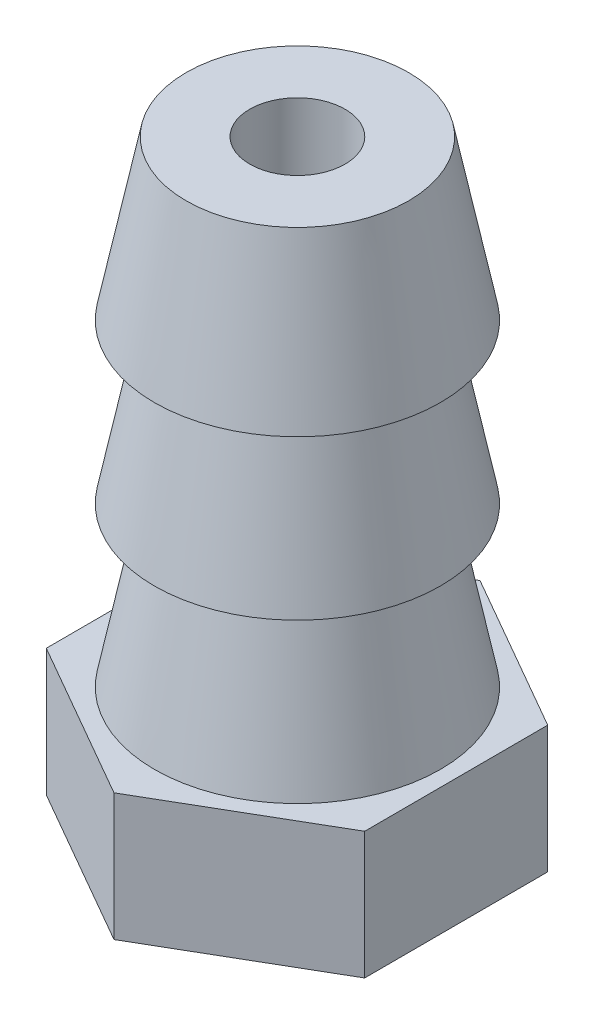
ISO-10303-21;
HEADER;
FILE_DESCRIPTION(('STEP AP214'),'2;1');
FILE_NAME('part.step','',(''),(''),'','','');
FILE_SCHEMA(('AUTOMOTIVE_DESIGN { 1 0 10303 214 1 1 1 1 }'));
ENDSEC;
DATA;
#1=APPLICATION_CONTEXT('core data for automotive mechanical design processes');
#2=APPLICATION_PROTOCOL_DEFINITION('international standard','automotive_design',2000,#1);
#3=PRODUCT_CONTEXT('',#1,'mechanical');
#4=PRODUCT('Part','Part','',(#3));
#5=PRODUCT_RELATED_PRODUCT_CATEGORY('part','',(#4));
#6=PRODUCT_DEFINITION_FORMATION('','',#4);
#7=PRODUCT_DEFINITION_CONTEXT('part definition',#1,'design');
#8=PRODUCT_DEFINITION('design','',#6,#7);
#9=PRODUCT_DEFINITION_SHAPE('','',#8);
#10=(LENGTH_UNIT() NAMED_UNIT(*) SI_UNIT(.MILLI.,.METRE.));
#11=(NAMED_UNIT(*) PLANE_ANGLE_UNIT() SI_UNIT($,.RADIAN.));
#12=(NAMED_UNIT(*) SI_UNIT($,.STERADIAN.) SOLID_ANGLE_UNIT());
#13=UNCERTAINTY_MEASURE_WITH_UNIT(LENGTH_MEASURE(1.E-05),#10,'distance_accuracy_value','');
#14=(GEOMETRIC_REPRESENTATION_CONTEXT(3) GLOBAL_UNCERTAINTY_ASSIGNED_CONTEXT((#13)) GLOBAL_UNIT_ASSIGNED_CONTEXT((#10,
#11,#12)) REPRESENTATION_CONTEXT('',''));
#15=CARTESIAN_POINT('',(0.,0.,0.));
#16=DIRECTION('',(0.,0.,1.));
#17=DIRECTION('',(1.,0.,0.));
#18=AXIS2_PLACEMENT_3D('',#15,#16,#17);
#19=CARTESIAN_POINT('',(-2.49679300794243,2.,1.44891614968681));
#20=DIRECTION('',(0.,1.,0.));
#21=DIRECTION('',(0.,0.,1.));
#22=AXIS2_PLACEMENT_3D('',#19,#20,#21);
#23=PLANE('',#22);
#24=DIRECTION('',(0.00221761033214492,0.,0.999997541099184));
#25=VECTOR('',#24,1.);
#26=CARTESIAN_POINT('',(-2.50319469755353,2.,-1.43782809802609));
#27=LINE('',#26,#25);
#28=CARTESIAN_POINT('',(-2.50319469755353,2.,-1.43782809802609));
#29=VERTEX_POINT('',#28);
#30=CARTESIAN_POINT('',(-2.49679300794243,2.,1.44891614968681));
#31=VERTEX_POINT('',#30);
#32=EDGE_CURVE('E130',#29,#31,#27,.T.);
#33=ORIENTED_EDGE('',*,*,#32,.T.);
#34=DIRECTION('',(0.867132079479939,0.,0.49807826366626));
#35=VECTOR('',#34,1.);
#36=CARTESIAN_POINT('',(-2.49679300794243,2.,1.44891614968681));
#37=LINE('',#36,#35);
#38=CARTESIAN_POINT('',(0.00640168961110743,2.,2.88674424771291));
#39=VERTEX_POINT('',#38);
#40=EDGE_CURVE('E88',#31,#39,#37,.T.);
#41=ORIENTED_EDGE('',*,*,#40,.T.);
#42=DIRECTION('',(0.864914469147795,0.,-0.501919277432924));
#43=VECTOR('',#42,1.);
#44=CARTESIAN_POINT('',(0.00640168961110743,2.,2.88674424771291));
#45=LINE('',#44,#43);
#46=CARTESIAN_POINT('',(2.50319469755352,2.,1.4378280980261));
#47=VERTEX_POINT('',#46);
#48=EDGE_CURVE('E101',#39,#47,#45,.T.);
#49=ORIENTED_EDGE('',*,*,#48,.T.);
#50=DIRECTION('',(-0.00221761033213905,0.,-0.999997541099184));
#51=VECTOR('',#50,1.);
#52=CARTESIAN_POINT('',(2.50319469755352,2.,1.4378280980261));
#53=LINE('',#52,#51);
#54=CARTESIAN_POINT('',(2.49679300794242,2.,-1.44891614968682));
#55=VERTEX_POINT('',#54);
#56=EDGE_CURVE('E95',#47,#55,#53,.T.);
#57=ORIENTED_EDGE('',*,*,#56,.T.);
#58=DIRECTION('',(-0.867132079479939,0.,-0.49807826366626));
#59=VECTOR('',#58,1.);
#60=CARTESIAN_POINT('',(2.49679300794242,2.,-1.44891614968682));
#61=LINE('',#60,#59);
#62=CARTESIAN_POINT('',(-0.0064016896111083,2.,-2.88674424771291));
#63=VERTEX_POINT('',#62);
#64=EDGE_CURVE('E99',#55,#63,#61,.T.);
#65=ORIENTED_EDGE('',*,*,#64,.T.);
#66=DIRECTION('',(-0.864914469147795,0.,0.501919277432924));
#67=VECTOR('',#66,1.);
#68=CARTESIAN_POINT('',(-0.0064016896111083,2.,-2.88674424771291));
#69=LINE('',#68,#67);
#70=EDGE_CURVE('E51',#63,#29,#69,.T.);
#71=ORIENTED_EDGE('',*,*,#70,.T.);
#72=EDGE_LOOP('',(#33,#41,#49,#57,#65,#71));
#73=FACE_BOUND('',#72,.T.);
#74=CARTESIAN_POINT('',(0.00640168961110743,2.,0.));
#75=DIRECTION('',(0.,-1.,0.));
#76=DIRECTION('',(0.,0.,-1.));
#77=AXIS2_PLACEMENT_3D('',#74,#75,#76);
#78=CIRCLE('',#77,2.25);
#79=CARTESIAN_POINT('',(0.00640168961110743,2.,-2.25));
#80=VERTEX_POINT('',#79);
#81=EDGE_CURVE('E123',#80,#80,#78,.T.);
#82=ORIENTED_EDGE('',*,*,#81,.T.);
#83=EDGE_LOOP('',(#82));
#84=FACE_BOUND('',#83,.T.);
#85=ADVANCED_FACE('F34',(#73,#84),#23,.T.);
#86=CARTESIAN_POINT('',(-2.50319469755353,2.,-1.43782809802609));
#87=DIRECTION('',(0.999997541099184,0.,-0.00221761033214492));
#88=DIRECTION('',(-0.00221761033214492,0.,-0.999997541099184));
#89=AXIS2_PLACEMENT_3D('',#86,#87,#88);
#90=PLANE('',#89);
#91=DIRECTION('',(0.00221761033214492,0.,0.999997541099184));
#92=VECTOR('',#91,1.);
#93=CARTESIAN_POINT('',(-2.50319469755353,0.,-1.43782809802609));
#94=LINE('',#93,#92);
#95=CARTESIAN_POINT('',(-2.50319469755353,0.,-1.43782809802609));
#96=VERTEX_POINT('',#95);
#97=CARTESIAN_POINT('',(-2.49679300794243,0.,1.44891614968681));
#98=VERTEX_POINT('',#97);
#99=EDGE_CURVE('E119',#96,#98,#94,.T.);
#100=ORIENTED_EDGE('',*,*,#99,.T.);
#101=DIRECTION('',(0.,-1.,0.));
#102=VECTOR('',#101,1.);
#103=CARTESIAN_POINT('',(-2.49679300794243,2.,1.44891614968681));
#104=LINE('',#103,#102);
#105=EDGE_CURVE('E11',#31,#98,#104,.T.);
#106=ORIENTED_EDGE('',*,*,#105,.F.);
#107=ORIENTED_EDGE('',*,*,#32,.F.);
#108=DIRECTION('',(0.,-1.,0.));
#109=VECTOR('',#108,1.);
#110=CARTESIAN_POINT('',(-2.50319469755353,2.,-1.43782809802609));
#111=LINE('',#110,#109);
#112=EDGE_CURVE('E115',#29,#96,#111,.T.);
#113=ORIENTED_EDGE('',*,*,#112,.T.);
#114=EDGE_LOOP('',(#100,#106,#107,#113));
#115=FACE_BOUND('',#114,.T.);
#116=ADVANCED_FACE('F36',(#115),#90,.F.);
#117=CARTESIAN_POINT('',(-2.49679300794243,2.,1.44891614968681));
#118=DIRECTION('',(0.49807826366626,0.,-0.867132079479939));
#119=DIRECTION('',(-0.867132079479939,0.,-0.49807826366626));
#120=AXIS2_PLACEMENT_3D('',#117,#118,#119);
#121=PLANE('',#120);
#122=DIRECTION('',(0.867132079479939,0.,0.49807826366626));
#123=VECTOR('',#122,1.);
#124=CARTESIAN_POINT('',(-2.49679300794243,0.,1.44891614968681));
#125=LINE('',#124,#123);
#126=CARTESIAN_POINT('',(0.00640168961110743,0.,2.88674424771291));
#127=VERTEX_POINT('',#126);
#128=EDGE_CURVE('E122',#98,#127,#125,.T.);
#129=ORIENTED_EDGE('',*,*,#128,.T.);
#130=DIRECTION('',(0.,-1.,0.));
#131=VECTOR('',#130,1.);
#132=CARTESIAN_POINT('',(0.00640168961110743,2.,2.88674424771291));
#133=LINE('',#132,#131);
#134=EDGE_CURVE('E43',#39,#127,#133,.T.);
#135=ORIENTED_EDGE('',*,*,#134,.F.);
#136=ORIENTED_EDGE('',*,*,#40,.F.);
#137=ORIENTED_EDGE('',*,*,#105,.T.);
#138=EDGE_LOOP('',(#129,#135,#136,#137));
#139=FACE_BOUND('',#138,.T.);
#140=ADVANCED_FACE('F159',(#139),#121,.F.);
#141=CARTESIAN_POINT('',(0.00640168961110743,2.,2.88674424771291));
#142=DIRECTION('',(-0.501919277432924,0.,-0.864914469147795));
#143=DIRECTION('',(-0.864914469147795,0.,0.501919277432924));
#144=AXIS2_PLACEMENT_3D('',#141,#142,#143);
#145=PLANE('',#144);
#146=DIRECTION('',(0.864914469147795,0.,-0.501919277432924));
#147=VECTOR('',#146,1.);
#148=CARTESIAN_POINT('',(0.00640168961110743,0.,2.88674424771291));
#149=LINE('',#148,#147);
#150=CARTESIAN_POINT('',(2.50319469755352,0.,1.4378280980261));
#151=VERTEX_POINT('',#150);
#152=EDGE_CURVE('E125',#127,#151,#149,.T.);
#153=ORIENTED_EDGE('',*,*,#152,.T.);
#154=DIRECTION('',(0.,-1.,0.));
#155=VECTOR('',#154,1.);
#156=CARTESIAN_POINT('',(2.50319469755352,2.,1.4378280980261));
#157=LINE('',#156,#155);
#158=EDGE_CURVE('E110',#47,#151,#157,.T.);
#159=ORIENTED_EDGE('',*,*,#158,.F.);
#160=ORIENTED_EDGE('',*,*,#48,.F.);
#161=ORIENTED_EDGE('',*,*,#134,.T.);
#162=EDGE_LOOP('',(#153,#159,#160,#161));
#163=FACE_BOUND('',#162,.T.);
#164=ADVANCED_FACE('F136',(#163),#145,.F.);
#165=CARTESIAN_POINT('',(2.50319469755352,2.,1.4378280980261));
#166=DIRECTION('',(-0.999997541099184,0.,0.00221761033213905));
#167=DIRECTION('',(0.00221761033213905,0.,0.999997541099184));
#168=AXIS2_PLACEMENT_3D('',#165,#166,#167);
#169=PLANE('',#168);
#170=DIRECTION('',(-0.00221761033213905,0.,-0.999997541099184));
#171=VECTOR('',#170,1.);
#172=CARTESIAN_POINT('',(2.50319469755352,0.,1.4378280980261));
#173=LINE('',#172,#171);
#174=CARTESIAN_POINT('',(2.49679300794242,0.,-1.44891614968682));
#175=VERTEX_POINT('',#174);
#176=EDGE_CURVE('E109',#151,#175,#173,.T.);
#177=ORIENTED_EDGE('',*,*,#176,.T.);
#178=DIRECTION('',(0.,-1.,0.));
#179=VECTOR('',#178,1.);
#180=CARTESIAN_POINT('',(2.49679300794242,2.,-1.44891614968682));
#181=LINE('',#180,#179);
#182=EDGE_CURVE('E106',#55,#175,#181,.T.);
#183=ORIENTED_EDGE('',*,*,#182,.F.);
#184=ORIENTED_EDGE('',*,*,#56,.F.);
#185=ORIENTED_EDGE('',*,*,#158,.T.);
#186=EDGE_LOOP('',(#177,#183,#184,#185));
#187=FACE_BOUND('',#186,.T.);
#188=ADVANCED_FACE('F107',(#187),#169,.F.);
#189=CARTESIAN_POINT('',(2.49679300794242,2.,-1.44891614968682));
#190=DIRECTION('',(-0.49807826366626,0.,0.867132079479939));
#191=DIRECTION('',(0.867132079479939,0.,0.49807826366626));
#192=AXIS2_PLACEMENT_3D('',#189,#190,#191);
#193=PLANE('',#192);
#194=DIRECTION('',(-0.867132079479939,0.,-0.49807826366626));
#195=VECTOR('',#194,1.);
#196=CARTESIAN_POINT('',(2.49679300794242,0.,-1.44891614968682));
#197=LINE('',#196,#195);
#198=CARTESIAN_POINT('',(-0.0064016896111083,0.,-2.88674424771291));
#199=VERTEX_POINT('',#198);
#200=EDGE_CURVE('E74',#175,#199,#197,.T.);
#201=ORIENTED_EDGE('',*,*,#200,.T.);
#202=DIRECTION('',(0.,-1.,0.));
#203=VECTOR('',#202,1.);
#204=CARTESIAN_POINT('',(-0.0064016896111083,2.,-2.88674424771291));
#205=LINE('',#204,#203);
#206=EDGE_CURVE('E111',#63,#199,#205,.T.);
#207=ORIENTED_EDGE('',*,*,#206,.F.);
#208=ORIENTED_EDGE('',*,*,#64,.F.);
#209=ORIENTED_EDGE('',*,*,#182,.T.);
#210=EDGE_LOOP('',(#201,#207,#208,#209));
#211=FACE_BOUND('',#210,.T.);
#212=ADVANCED_FACE('F113',(#211),#193,.F.);
#213=CARTESIAN_POINT('',(-0.0064016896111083,2.,-2.88674424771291));
#214=DIRECTION('',(0.501919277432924,0.,0.864914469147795));
#215=DIRECTION('',(0.864914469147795,0.,-0.501919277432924));
#216=AXIS2_PLACEMENT_3D('',#213,#214,#215);
#217=PLANE('',#216);
#218=DIRECTION('',(-0.864914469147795,0.,0.501919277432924));
#219=VECTOR('',#218,1.);
#220=CARTESIAN_POINT('',(-0.0064016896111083,0.,-2.88674424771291));
#221=LINE('',#220,#219);
#222=EDGE_CURVE('E80',#199,#96,#221,.T.);
#223=ORIENTED_EDGE('',*,*,#222,.T.);
#224=ORIENTED_EDGE('',*,*,#112,.F.);
#225=ORIENTED_EDGE('',*,*,#70,.F.);
#226=ORIENTED_EDGE('',*,*,#206,.T.);
#227=EDGE_LOOP('',(#223,#224,#225,#226));
#228=FACE_BOUND('',#227,.T.);
#229=ADVANCED_FACE('F143',(#228),#217,.F.);
#230=CARTESIAN_POINT('',(-2.49679300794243,0.,1.44891614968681));
#231=DIRECTION('',(0.,1.,0.));
#232=DIRECTION('',(0.,0.,1.));
#233=AXIS2_PLACEMENT_3D('',#230,#231,#232);
#234=PLANE('',#233);
#235=CARTESIAN_POINT('',(0.00640168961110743,0.,0.));
#236=DIRECTION('',(0.,1.,0.));
#237=DIRECTION('',(0.,0.,1.));
#238=AXIS2_PLACEMENT_3D('',#235,#236,#237);
#239=CIRCLE('',#238,0.75);
#240=CARTESIAN_POINT('',(0.00640168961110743,0.,0.75));
#241=VERTEX_POINT('',#240);
#242=EDGE_CURVE('E192',#241,#241,#239,.T.);
#243=ORIENTED_EDGE('',*,*,#242,.T.);
#244=EDGE_LOOP('',(#243));
#245=FACE_BOUND('',#244,.T.);
#246=ORIENTED_EDGE('',*,*,#99,.F.);
#247=ORIENTED_EDGE('',*,*,#222,.F.);
#248=ORIENTED_EDGE('',*,*,#200,.F.);
#249=ORIENTED_EDGE('',*,*,#176,.F.);
#250=ORIENTED_EDGE('',*,*,#152,.F.);
#251=ORIENTED_EDGE('',*,*,#128,.F.);
#252=EDGE_LOOP('',(#246,#247,#248,#249,#250,#251));
#253=FACE_BOUND('',#252,.T.);
#254=ADVANCED_FACE('F139',(#245,#253),#234,.F.);
#255=CARTESIAN_POINT('',(0.00640168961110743,4.5,0.));
#256=DIRECTION('',(0.,-1.,0.));
#257=DIRECTION('',(0.,0.,-1.));
#258=AXIS2_PLACEMENT_3D('',#255,#256,#257);
#259=CONICAL_SURFACE('',#258,1.75,0.197395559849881);
#260=ORIENTED_EDGE('',*,*,#81,.F.);
#261=EDGE_LOOP('',(#260));
#262=FACE_BOUND('',#261,.T.);
#263=CARTESIAN_POINT('',(0.00640168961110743,4.5,0.));
#264=DIRECTION('',(0.,-1.,0.));
#265=DIRECTION('',(0.,0.,-1.));
#266=AXIS2_PLACEMENT_3D('',#263,#264,#265);
#267=CIRCLE('',#266,1.75);
#268=CARTESIAN_POINT('',(0.00640168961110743,4.5,-1.75));
#269=VERTEX_POINT('',#268);
#270=EDGE_CURVE('E211',#269,#269,#267,.T.);
#271=ORIENTED_EDGE('',*,*,#270,.T.);
#272=EDGE_LOOP('',(#271));
#273=FACE_BOUND('',#272,.T.);
#274=ADVANCED_FACE('F150',(#262,#273),#259,.T.);
#275=CARTESIAN_POINT('',(-1.74359831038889,4.5,0.));
#276=DIRECTION('',(0.,1.,0.));
#277=DIRECTION('',(0.,0.,1.));
#278=AXIS2_PLACEMENT_3D('',#275,#276,#277);
#279=PLANE('',#278);
#280=ORIENTED_EDGE('',*,*,#270,.F.);
#281=EDGE_LOOP('',(#280));
#282=FACE_BOUND('',#281,.T.);
#283=CARTESIAN_POINT('',(0.00640168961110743,4.5,0.));
#284=DIRECTION('',(0.,-1.,0.));
#285=DIRECTION('',(0.,0.,-1.));
#286=AXIS2_PLACEMENT_3D('',#283,#284,#285);
#287=CIRCLE('',#286,2.25);
#288=CARTESIAN_POINT('',(0.00640168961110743,4.5,-2.25));
#289=VERTEX_POINT('',#288);
#290=EDGE_CURVE('E208',#289,#289,#287,.T.);
#291=ORIENTED_EDGE('',*,*,#290,.T.);
#292=EDGE_LOOP('',(#291));
#293=FACE_BOUND('',#292,.T.);
#294=ADVANCED_FACE('F163',(#282,#293),#279,.F.);
#295=CARTESIAN_POINT('',(0.00640168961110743,7.,0.));
#296=DIRECTION('',(0.,-1.,0.));
#297=DIRECTION('',(0.,0.,-1.));
#298=AXIS2_PLACEMENT_3D('',#295,#296,#297);
#299=CONICAL_SURFACE('',#298,1.75,0.197395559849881);
#300=ORIENTED_EDGE('',*,*,#290,.F.);
#301=EDGE_LOOP('',(#300));
#302=FACE_BOUND('',#301,.T.);
#303=CARTESIAN_POINT('',(0.00640168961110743,7.,0.));
#304=DIRECTION('',(0.,-1.,0.));
#305=DIRECTION('',(0.,0.,-1.));
#306=AXIS2_PLACEMENT_3D('',#303,#304,#305);
#307=CIRCLE('',#306,1.75);
#308=CARTESIAN_POINT('',(0.00640168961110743,7.,-1.75));
#309=VERTEX_POINT('',#308);
#310=EDGE_CURVE('E205',#309,#309,#307,.T.);
#311=ORIENTED_EDGE('',*,*,#310,.T.);
#312=EDGE_LOOP('',(#311));
#313=FACE_BOUND('',#312,.T.);
#314=ADVANCED_FACE('F167',(#302,#313),#299,.T.);
#315=CARTESIAN_POINT('',(-1.74359831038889,7.,0.));
#316=DIRECTION('',(0.,1.,0.));
#317=DIRECTION('',(0.,0.,1.));
#318=AXIS2_PLACEMENT_3D('',#315,#316,#317);
#319=PLANE('',#318);
#320=ORIENTED_EDGE('',*,*,#310,.F.);
#321=EDGE_LOOP('',(#320));
#322=FACE_BOUND('',#321,.T.);
#323=CARTESIAN_POINT('',(0.00640168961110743,7.,0.));
#324=DIRECTION('',(0.,-1.,0.));
#325=DIRECTION('',(0.,0.,-1.));
#326=AXIS2_PLACEMENT_3D('',#323,#324,#325);
#327=CIRCLE('',#326,2.25);
#328=CARTESIAN_POINT('',(0.00640168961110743,7.,-2.25));
#329=VERTEX_POINT('',#328);
#330=EDGE_CURVE('E202',#329,#329,#327,.T.);
#331=ORIENTED_EDGE('',*,*,#330,.T.);
#332=EDGE_LOOP('',(#331));
#333=FACE_BOUND('',#332,.T.);
#334=ADVANCED_FACE('F171',(#322,#333),#319,.F.);
#335=CARTESIAN_POINT('',(0.00640168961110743,9.5,0.));
#336=DIRECTION('',(0.,-1.,0.));
#337=DIRECTION('',(0.,0.,-1.));
#338=AXIS2_PLACEMENT_3D('',#335,#336,#337);
#339=CONICAL_SURFACE('',#338,1.75,0.197395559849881);
#340=ORIENTED_EDGE('',*,*,#330,.F.);
#341=EDGE_LOOP('',(#340));
#342=FACE_BOUND('',#341,.T.);
#343=CARTESIAN_POINT('',(0.00640168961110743,9.5,0.));
#344=DIRECTION('',(0.,-1.,0.));
#345=DIRECTION('',(0.,0.,-1.));
#346=AXIS2_PLACEMENT_3D('',#343,#344,#345);
#347=CIRCLE('',#346,1.75);
#348=CARTESIAN_POINT('',(0.00640168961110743,9.5,-1.75));
#349=VERTEX_POINT('',#348);
#350=EDGE_CURVE('E197',#349,#349,#347,.T.);
#351=ORIENTED_EDGE('',*,*,#350,.T.);
#352=EDGE_LOOP('',(#351));
#353=FACE_BOUND('',#352,.T.);
#354=ADVANCED_FACE('F175',(#342,#353),#339,.T.);
#355=CARTESIAN_POINT('',(-1.74359831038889,9.5,0.));
#356=DIRECTION('',(0.,-1.,0.));
#357=DIRECTION('',(0.,0.,-1.));
#358=AXIS2_PLACEMENT_3D('',#355,#356,#357);
#359=PLANE('',#358);
#360=CARTESIAN_POINT('',(0.00640168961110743,9.5,0.));
#361=DIRECTION('',(0.,1.,0.));
#362=DIRECTION('',(0.,0.,1.));
#363=AXIS2_PLACEMENT_3D('',#360,#361,#362);
#364=CIRCLE('',#363,0.75);
#365=CARTESIAN_POINT('',(0.00640168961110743,9.5,0.75));
#366=VERTEX_POINT('',#365);
#367=EDGE_CURVE('E195',#366,#366,#364,.T.);
#368=ORIENTED_EDGE('',*,*,#367,.F.);
#369=EDGE_LOOP('',(#368));
#370=FACE_BOUND('',#369,.T.);
#371=ORIENTED_EDGE('',*,*,#350,.F.);
#372=EDGE_LOOP('',(#371));
#373=FACE_BOUND('',#372,.T.);
#374=ADVANCED_FACE('F179',(#370,#373),#359,.F.);
#375=CARTESIAN_POINT('',(0.00640168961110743,0.,0.));
#376=DIRECTION('',(0.,1.,0.));
#377=DIRECTION('',(0.,0.,1.));
#378=AXIS2_PLACEMENT_3D('',#375,#376,#377);
#379=CYLINDRICAL_SURFACE('',#378,0.75);
#380=ORIENTED_EDGE('',*,*,#242,.F.);
#381=EDGE_LOOP('',(#380));
#382=FACE_BOUND('',#381,.T.);
#383=ORIENTED_EDGE('',*,*,#367,.T.);
#384=EDGE_LOOP('',(#383));
#385=FACE_BOUND('',#384,.T.);
#386=ADVANCED_FACE('F183',(#382,#385),#379,.F.);
#387=CLOSED_SHELL('',(#85,#116,#140,#164,#188,#212,#229,#254,#274,#294,#314,#334,#354,#374,#386));
#388=MANIFOLD_SOLID_BREP('B2',#387);
#389=ADVANCED_BREP_SHAPE_REPRESENTATION('',(#18,#388),#14);
#390=SHAPE_DEFINITION_REPRESENTATION(#9,#389);
ENDSEC;
END-ISO-10303-21;
